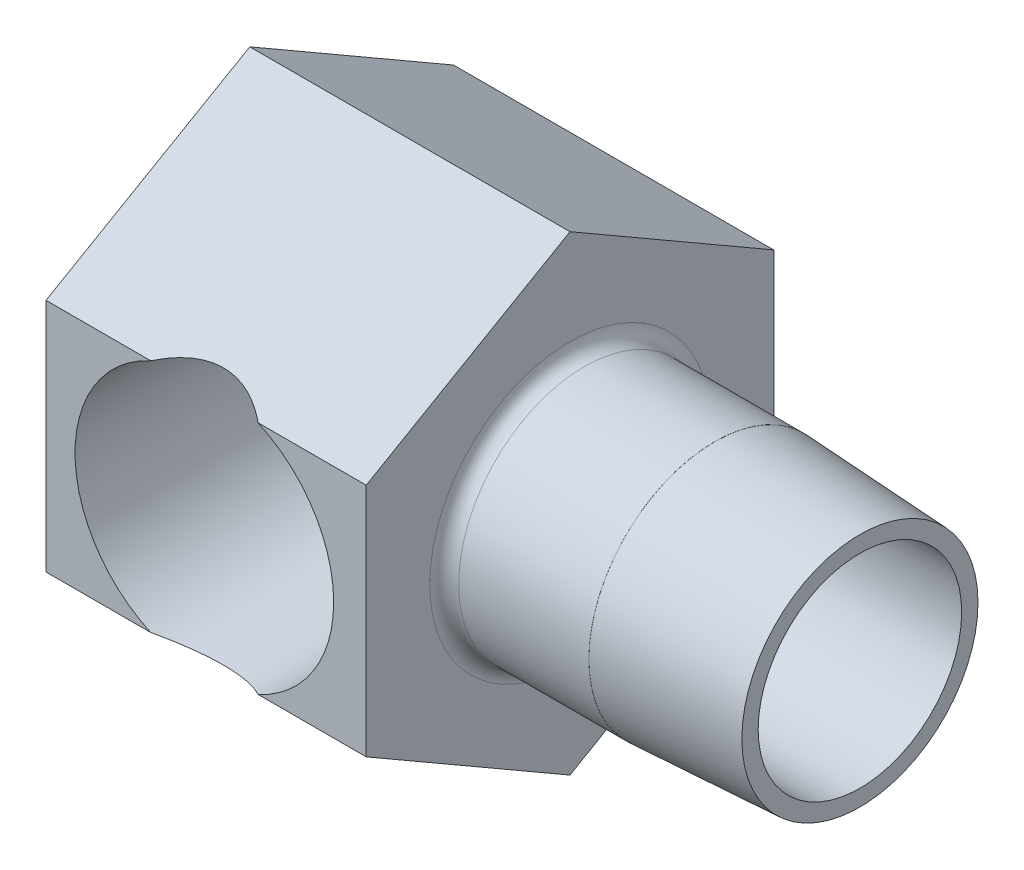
ISO-10303-21;
HEADER;
FILE_DESCRIPTION(('STEP AP214'),'2;1');
FILE_NAME('part.step','',(''),(''),'','','');
FILE_SCHEMA(('AUTOMOTIVE_DESIGN { 1 0 10303 214 1 1 1 1 }'));
ENDSEC;
DATA;
#1=APPLICATION_CONTEXT('core data for automotive mechanical design processes');
#2=APPLICATION_PROTOCOL_DEFINITION('international standard','automotive_design',2000,#1);
#3=PRODUCT_CONTEXT('',#1,'mechanical');
#4=PRODUCT('Part','Part','',(#3));
#5=PRODUCT_RELATED_PRODUCT_CATEGORY('part','',(#4));
#6=PRODUCT_DEFINITION_FORMATION('','',#4);
#7=PRODUCT_DEFINITION_CONTEXT('part definition',#1,'design');
#8=PRODUCT_DEFINITION('design','',#6,#7);
#9=PRODUCT_DEFINITION_SHAPE('','',#8);
#10=(LENGTH_UNIT() NAMED_UNIT(*) SI_UNIT(.MILLI.,.METRE.));
#11=(NAMED_UNIT(*) PLANE_ANGLE_UNIT() SI_UNIT($,.RADIAN.));
#12=(NAMED_UNIT(*) SI_UNIT($,.STERADIAN.) SOLID_ANGLE_UNIT());
#13=UNCERTAINTY_MEASURE_WITH_UNIT(LENGTH_MEASURE(1.E-05),#10,'distance_accuracy_value','');
#14=(GEOMETRIC_REPRESENTATION_CONTEXT(3) GLOBAL_UNCERTAINTY_ASSIGNED_CONTEXT((#13)) GLOBAL_UNIT_ASSIGNED_CONTEXT((#10,
#11,#12)) REPRESENTATION_CONTEXT('',''));
#15=CARTESIAN_POINT('',(0.,0.,0.));
#16=DIRECTION('',(0.,0.,1.));
#17=DIRECTION('',(1.,0.,0.));
#18=AXIS2_PLACEMENT_3D('',#15,#16,#17);
#19=CARTESIAN_POINT('',(7.9248,0.,0.));
#20=DIRECTION('',(-1.,0.,0.));
#21=DIRECTION('',(0.,0.,1.));
#22=AXIS2_PLACEMENT_3D('',#19,#20,#21);
#23=PLANE('',#22);
#24=CARTESIAN_POINT('',(7.9248,0.,0.));
#25=DIRECTION('',(-1.,0.,0.));
#26=DIRECTION('',(0.,0.,1.));
#27=AXIS2_PLACEMENT_3D('',#24,#25,#26);
#28=CIRCLE('',#27,5.5499);
#29=CARTESIAN_POINT('',(7.9248,0.,5.5499));
#30=VERTEX_POINT('',#29);
#31=EDGE_CURVE('E113',#30,#30,#28,.F.);
#32=ORIENTED_EDGE('',*,*,#31,.F.);
#33=EDGE_LOOP('',(#32));
#34=FACE_BOUND('',#33,.T.);
#35=CARTESIAN_POINT('',(7.9248,0.,0.));
#36=DIRECTION('',(1.,0.,0.));
#37=DIRECTION('',(0.,0.,-1.));
#38=AXIS2_PLACEMENT_3D('',#35,#36,#37);
#39=CIRCLE('',#38,6.4389);
#40=CARTESIAN_POINT('',(7.9248,0.,-6.4389));
#41=VERTEX_POINT('',#40);
#42=EDGE_CURVE('E211',#41,#41,#39,.T.);
#43=ORIENTED_EDGE('',*,*,#42,.T.);
#44=EDGE_LOOP('',(#43));
#45=FACE_BOUND('',#44,.T.);
#46=ADVANCED_FACE('F14',(#34,#45),#23,.F.);
#47=CARTESIAN_POINT('',(-7.8867,6.4158048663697,11.1125));
#48=DIRECTION('',(0.,0.,-1.));
#49=DIRECTION('',(0.,1.,0.));
#50=AXIS2_PLACEMENT_3D('',#47,#48,#49);
#51=PLANE('',#50);
#52=CARTESIAN_POINT('',(-16.7132,0.,11.1125));
#53=DIRECTION('',(0.,0.,1.));
#54=DIRECTION('',(1.,0.,0.));
#55=AXIS2_PLACEMENT_3D('',#52,#53,#54);
#56=CIRCLE('',#55,7.05231);
#57=CARTESIAN_POINT('',(-19.6410873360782,6.4158048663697,11.1125));
#58=VERTEX_POINT('',#57);
#59=CARTESIAN_POINT('',(-19.6410873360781,-6.41580486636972,11.1125));
#60=VERTEX_POINT('',#59);
#61=EDGE_CURVE('E220',#58,#60,#56,.T.);
#62=ORIENTED_EDGE('',*,*,#61,.F.);
#63=DIRECTION('',(-1.,0.,0.));
#64=VECTOR('',#63,1.);
#65=CARTESIAN_POINT('',(-7.8867,6.4158048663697,11.1125));
#66=LINE('',#65,#64);
#67=CARTESIAN_POINT('',(-25.3492,6.4158048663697,11.1125));
#68=VERTEX_POINT('',#67);
#69=EDGE_CURVE('E155',#58,#68,#66,.T.);
#70=ORIENTED_EDGE('',*,*,#69,.T.);
#71=DIRECTION('',(0.,-1.,0.));
#72=VECTOR('',#71,1.);
#73=CARTESIAN_POINT('',(-25.3492,6.4158048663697,11.1125));
#74=LINE('',#73,#72);
#75=CARTESIAN_POINT('',(-25.3492,-6.41580486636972,11.1125));
#76=VERTEX_POINT('',#75);
#77=EDGE_CURVE('E125',#68,#76,#74,.T.);
#78=ORIENTED_EDGE('',*,*,#77,.T.);
#79=DIRECTION('',(-1.,0.,0.));
#80=VECTOR('',#79,1.);
#81=CARTESIAN_POINT('',(-7.8867,-6.41580486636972,11.1125));
#82=LINE('',#81,#80);
#83=EDGE_CURVE('E151',#60,#76,#82,.T.);
#84=ORIENTED_EDGE('',*,*,#83,.F.);
#85=EDGE_LOOP('',(#62,#70,#78,#84));
#86=FACE_BOUND('',#85,.T.);
#87=ADVANCED_FACE('F208',(#86),#51,.F.);
#88=CARTESIAN_POINT('',(-13.7853126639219,-6.41580486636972,11.1125));
#89=VERTEX_POINT('',#88);
#90=CARTESIAN_POINT('',(-13.7853126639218,6.4158048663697,11.1125));
#91=VERTEX_POINT('',#90);
#92=EDGE_CURVE('E216',#89,#91,#56,.T.);
#93=ORIENTED_EDGE('',*,*,#92,.F.);
#94=CARTESIAN_POINT('',(-7.8867,-6.41580486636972,11.1125));
#95=VERTEX_POINT('',#94);
#96=EDGE_CURVE('E152',#95,#89,#82,.T.);
#97=ORIENTED_EDGE('',*,*,#96,.F.);
#98=DIRECTION('',(0.,-1.,0.));
#99=VECTOR('',#98,1.);
#100=CARTESIAN_POINT('',(-7.8867,6.4158048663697,11.1125));
#101=LINE('',#100,#99);
#102=CARTESIAN_POINT('',(-7.8867,6.4158048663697,11.1125));
#103=VERTEX_POINT('',#102);
#104=EDGE_CURVE('E142',#103,#95,#101,.T.);
#105=ORIENTED_EDGE('',*,*,#104,.F.);
#106=EDGE_CURVE('E156',#103,#91,#66,.T.);
#107=ORIENTED_EDGE('',*,*,#106,.T.);
#108=EDGE_LOOP('',(#93,#97,#105,#107));
#109=FACE_BOUND('',#108,.T.);
#110=ADVANCED_FACE('F248',(#109),#51,.F.);
#111=CARTESIAN_POINT('',(-7.8867,12.8316097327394,0.));
#112=DIRECTION('',(0.,-0.866025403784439,-0.5));
#113=DIRECTION('',(0.,0.5,-0.866025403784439));
#114=AXIS2_PLACEMENT_3D('',#111,#112,#113);
#115=PLANE('',#114);
#116=ORIENTED_EDGE('',*,*,#69,.F.);
#117=CARTESIAN_POINT('',(-16.7132,-0.384020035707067,22.890142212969));
#118=DIRECTION('',(0.,-0.866025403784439,-0.5));
#119=DIRECTION('',(0.,-0.5,0.866025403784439));
#120=AXIS2_PLACEMENT_3D('',#117,#118,#119);
#121=ELLIPSE('',#120,14.8098967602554,7.39498405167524);
#122=EDGE_CURVE('E105',#58,#91,#121,.T.);
#123=ORIENTED_EDGE('',*,*,#122,.T.);
#124=ORIENTED_EDGE('',*,*,#106,.F.);
#125=DIRECTION('',(0.,-0.5,0.866025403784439));
#126=VECTOR('',#125,1.);
#127=CARTESIAN_POINT('',(-7.8867,12.8316097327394,0.));
#128=LINE('',#127,#126);
#129=CARTESIAN_POINT('',(-7.8867,12.8316097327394,0.));
#130=VERTEX_POINT('',#129);
#131=EDGE_CURVE('E140',#130,#103,#128,.T.);
#132=ORIENTED_EDGE('',*,*,#131,.F.);
#133=DIRECTION('',(-1.,0.,0.));
#134=VECTOR('',#133,1.);
#135=CARTESIAN_POINT('',(-7.8867,12.8316097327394,0.));
#136=LINE('',#135,#134);
#137=CARTESIAN_POINT('',(-25.3492,12.8316097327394,0.));
#138=VERTEX_POINT('',#137);
#139=EDGE_CURVE('E159',#130,#138,#136,.T.);
#140=ORIENTED_EDGE('',*,*,#139,.T.);
#141=DIRECTION('',(0.,-0.5,0.866025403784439));
#142=VECTOR('',#141,1.);
#143=CARTESIAN_POINT('',(-25.3492,12.8316097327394,0.));
#144=LINE('',#143,#142);
#145=EDGE_CURVE('E121',#138,#68,#144,.T.);
#146=ORIENTED_EDGE('',*,*,#145,.T.);
#147=EDGE_LOOP('',(#116,#123,#124,#132,#140,#146));
#148=FACE_BOUND('',#147,.T.);
#149=ADVANCED_FACE('F250',(#148),#115,.F.);
#150=CARTESIAN_POINT('',(-7.8867,-6.41580486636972,11.1125));
#151=DIRECTION('',(0.,0.866025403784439,-0.5));
#152=DIRECTION('',(0.,0.5,0.866025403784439));
#153=AXIS2_PLACEMENT_3D('',#150,#151,#152);
#154=PLANE('',#153);
#155=ORIENTED_EDGE('',*,*,#96,.T.);
#156=CARTESIAN_POINT('',(-16.7132,0.384020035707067,22.890142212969));
#157=DIRECTION('',(0.,0.866025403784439,-0.5));
#158=DIRECTION('',(0.,0.5,0.866025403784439));
#159=AXIS2_PLACEMENT_3D('',#156,#157,#158);
#160=ELLIPSE('',#159,14.8098967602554,7.39498405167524);
#161=EDGE_CURVE('E30',#89,#60,#160,.T.);
#162=ORIENTED_EDGE('',*,*,#161,.T.);
#163=ORIENTED_EDGE('',*,*,#83,.T.);
#164=DIRECTION('',(0.,-0.5,-0.866025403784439));
#165=VECTOR('',#164,1.);
#166=CARTESIAN_POINT('',(-25.3492,-6.41580486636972,11.1125));
#167=LINE('',#166,#165);
#168=CARTESIAN_POINT('',(-25.3492,-12.8316097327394,0.));
#169=VERTEX_POINT('',#168);
#170=EDGE_CURVE('E129',#76,#169,#167,.T.);
#171=ORIENTED_EDGE('',*,*,#170,.T.);
#172=DIRECTION('',(-1.,0.,0.));
#173=VECTOR('',#172,1.);
#174=CARTESIAN_POINT('',(-7.8867,-12.8316097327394,0.));
#175=LINE('',#174,#173);
#176=CARTESIAN_POINT('',(-7.8867,-12.8316097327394,0.));
#177=VERTEX_POINT('',#176);
#178=EDGE_CURVE('E146',#177,#169,#175,.T.);
#179=ORIENTED_EDGE('',*,*,#178,.F.);
#180=DIRECTION('',(0.,-0.5,-0.866025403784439));
#181=VECTOR('',#180,1.);
#182=CARTESIAN_POINT('',(-7.8867,-6.41580486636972,11.1125));
#183=LINE('',#182,#181);
#184=EDGE_CURVE('E144',#95,#177,#183,.T.);
#185=ORIENTED_EDGE('',*,*,#184,.F.);
#186=EDGE_LOOP('',(#155,#162,#163,#171,#179,#185));
#187=FACE_BOUND('',#186,.T.);
#188=ADVANCED_FACE('F227',(#187),#154,.F.);
#189=CARTESIAN_POINT('',(-7.8867,-12.8316097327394,0.));
#190=DIRECTION('',(0.,0.866025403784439,0.5));
#191=DIRECTION('',(0.,-0.5,0.866025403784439));
#192=AXIS2_PLACEMENT_3D('',#189,#190,#191);
#193=PLANE('',#192);
#194=DIRECTION('',(0.,0.5,-0.866025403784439));
#195=VECTOR('',#194,1.);
#196=CARTESIAN_POINT('',(-25.3492,-12.8316097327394,0.));
#197=LINE('',#196,#195);
#198=CARTESIAN_POINT('',(-25.3492,-6.41580486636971,-11.1125));
#199=VERTEX_POINT('',#198);
#200=EDGE_CURVE('E118',#169,#199,#197,.T.);
#201=ORIENTED_EDGE('',*,*,#200,.T.);
#202=DIRECTION('',(-1.,0.,0.));
#203=VECTOR('',#202,1.);
#204=CARTESIAN_POINT('',(-7.8867,-6.41580486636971,-11.1125));
#205=LINE('',#204,#203);
#206=CARTESIAN_POINT('',(-7.8867,-6.41580486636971,-11.1125));
#207=VERTEX_POINT('',#206);
#208=EDGE_CURVE('E165',#207,#199,#205,.T.);
#209=ORIENTED_EDGE('',*,*,#208,.F.);
#210=DIRECTION('',(0.,0.5,-0.866025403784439));
#211=VECTOR('',#210,1.);
#212=CARTESIAN_POINT('',(-7.8867,-12.8316097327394,0.));
#213=LINE('',#212,#211);
#214=EDGE_CURVE('E132',#177,#207,#213,.T.);
#215=ORIENTED_EDGE('',*,*,#214,.F.);
#216=ORIENTED_EDGE('',*,*,#178,.T.);
#217=EDGE_LOOP('',(#201,#209,#215,#216));
#218=FACE_BOUND('',#217,.T.);
#219=ADVANCED_FACE('F239',(#218),#193,.F.);
#220=CARTESIAN_POINT('',(-7.8867,-6.41580486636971,-11.1125));
#221=DIRECTION('',(0.,0.,1.));
#222=DIRECTION('',(1.,0.,0.));
#223=AXIS2_PLACEMENT_3D('',#220,#221,#222);
#224=PLANE('',#223);
#225=DIRECTION('',(0.,1.,0.));
#226=VECTOR('',#225,1.);
#227=CARTESIAN_POINT('',(-25.3492,-6.41580486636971,-11.1125));
#228=LINE('',#227,#226);
#229=CARTESIAN_POINT('',(-25.3492,6.41580486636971,-11.1125));
#230=VERTEX_POINT('',#229);
#231=EDGE_CURVE('E114',#199,#230,#228,.T.);
#232=ORIENTED_EDGE('',*,*,#231,.T.);
#233=DIRECTION('',(-1.,0.,0.));
#234=VECTOR('',#233,1.);
#235=CARTESIAN_POINT('',(-7.8867,6.41580486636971,-11.1125));
#236=LINE('',#235,#234);
#237=CARTESIAN_POINT('',(-7.8867,6.41580486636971,-11.1125));
#238=VERTEX_POINT('',#237);
#239=EDGE_CURVE('E162',#238,#230,#236,.T.);
#240=ORIENTED_EDGE('',*,*,#239,.F.);
#241=DIRECTION('',(0.,1.,0.));
#242=VECTOR('',#241,1.);
#243=CARTESIAN_POINT('',(-7.8867,-6.41580486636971,-11.1125));
#244=LINE('',#243,#242);
#245=EDGE_CURVE('E136',#207,#238,#244,.T.);
#246=ORIENTED_EDGE('',*,*,#245,.F.);
#247=ORIENTED_EDGE('',*,*,#208,.T.);
#248=EDGE_LOOP('',(#232,#240,#246,#247));
#249=FACE_BOUND('',#248,.T.);
#250=ADVANCED_FACE('F257',(#249),#224,.F.);
#251=CARTESIAN_POINT('',(-7.8867,6.4158048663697,-11.1125));
#252=DIRECTION('',(0.,-0.866025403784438,0.5));
#253=DIRECTION('',(0.,-0.5,-0.866025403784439));
#254=AXIS2_PLACEMENT_3D('',#251,#252,#253);
#255=PLANE('',#254);
#256=DIRECTION('',(0.,0.5,0.866025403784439));
#257=VECTOR('',#256,1.);
#258=CARTESIAN_POINT('',(-25.3492,6.4158048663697,-11.1125));
#259=LINE('',#258,#257);
#260=EDGE_CURVE('E117',#230,#138,#259,.T.);
#261=ORIENTED_EDGE('',*,*,#260,.T.);
#262=ORIENTED_EDGE('',*,*,#139,.F.);
#263=DIRECTION('',(0.,0.5,0.866025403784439));
#264=VECTOR('',#263,1.);
#265=CARTESIAN_POINT('',(-7.8867,6.4158048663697,-11.1125));
#266=LINE('',#265,#264);
#267=EDGE_CURVE('E138',#238,#130,#266,.T.);
#268=ORIENTED_EDGE('',*,*,#267,.F.);
#269=ORIENTED_EDGE('',*,*,#239,.T.);
#270=EDGE_LOOP('',(#261,#262,#268,#269));
#271=FACE_BOUND('',#270,.T.);
#272=ADVANCED_FACE('F254',(#271),#255,.F.);
#273=CARTESIAN_POINT('',(-7.8867,-19.2474145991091,11.1125));
#274=DIRECTION('',(-1.,0.,0.));
#275=DIRECTION('',(0.,-1.,0.));
#276=AXIS2_PLACEMENT_3D('',#273,#274,#275);
#277=PLANE('',#276);
#278=CARTESIAN_POINT('',(-7.8867,0.,0.));
#279=DIRECTION('',(-1.,0.,0.));
#280=DIRECTION('',(0.,-1.,0.));
#281=AXIS2_PLACEMENT_3D('',#278,#279,#280);
#282=CIRCLE('',#281,7.6454);
#283=CARTESIAN_POINT('',(-7.8867,-7.6454,0.));
#284=VERTEX_POINT('',#283);
#285=EDGE_CURVE('E168',#284,#284,#282,.T.);
#286=ORIENTED_EDGE('',*,*,#285,.T.);
#287=EDGE_LOOP('',(#286));
#288=FACE_BOUND('',#287,.T.);
#289=ORIENTED_EDGE('',*,*,#214,.T.);
#290=ORIENTED_EDGE('',*,*,#245,.T.);
#291=ORIENTED_EDGE('',*,*,#267,.T.);
#292=ORIENTED_EDGE('',*,*,#131,.T.);
#293=ORIENTED_EDGE('',*,*,#104,.T.);
#294=ORIENTED_EDGE('',*,*,#184,.T.);
#295=EDGE_LOOP('',(#289,#290,#291,#292,#293,#294));
#296=FACE_BOUND('',#295,.T.);
#297=ADVANCED_FACE('F242',(#288,#296),#277,.F.);
#298=CARTESIAN_POINT('',(-25.3492,-19.2474145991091,11.1125));
#299=DIRECTION('',(-1.,0.,0.));
#300=DIRECTION('',(0.,-1.,0.));
#301=AXIS2_PLACEMENT_3D('',#298,#299,#300);
#302=PLANE('',#301);
#303=ORIENTED_EDGE('',*,*,#200,.F.);
#304=ORIENTED_EDGE('',*,*,#170,.F.);
#305=ORIENTED_EDGE('',*,*,#77,.F.);
#306=ORIENTED_EDGE('',*,*,#145,.F.);
#307=ORIENTED_EDGE('',*,*,#260,.F.);
#308=ORIENTED_EDGE('',*,*,#231,.F.);
#309=EDGE_LOOP('',(#303,#304,#305,#306,#307,#308));
#310=FACE_BOUND('',#309,.T.);
#311=ADVANCED_FACE('F235',(#310),#302,.T.);
#312=CARTESIAN_POINT('',(38.1508,0.,0.));
#313=DIRECTION('',(-1.,0.,0.));
#314=DIRECTION('',(0.,0.,1.));
#315=AXIS2_PLACEMENT_3D('',#312,#313,#314);
#316=CYLINDRICAL_SURFACE('',#315,6.858);
#317=CARTESIAN_POINT('',(0.,0.,0.));
#318=DIRECTION('',(-1.,0.,0.));
#319=DIRECTION('',(0.,0.,1.));
#320=AXIS2_PLACEMENT_3D('',#317,#318,#319);
#321=CIRCLE('',#320,6.858);
#322=CARTESIAN_POINT('',(0.,0.,6.858));
#323=VERTEX_POINT('',#322);
#324=EDGE_CURVE('E17',#323,#323,#321,.F.);
#325=ORIENTED_EDGE('',*,*,#324,.F.);
#326=EDGE_LOOP('',(#325));
#327=FACE_BOUND('',#326,.T.);
#328=CARTESIAN_POINT('',(-7.0993,0.,0.));
#329=DIRECTION('',(-1.,0.,0.));
#330=DIRECTION('',(0.,-1.,0.));
#331=AXIS2_PLACEMENT_3D('',#328,#329,#330);
#332=CIRCLE('',#331,6.858);
#333=CARTESIAN_POINT('',(-7.0993,-6.858,0.));
#334=VERTEX_POINT('',#333);
#335=EDGE_CURVE('E171',#334,#334,#332,.F.);
#336=ORIENTED_EDGE('',*,*,#335,.T.);
#337=EDGE_LOOP('',(#336));
#338=FACE_BOUND('',#337,.T.);
#339=ADVANCED_FACE('F279',(#327,#338),#316,.T.);
#340=CARTESIAN_POINT('',(-7.0993,0.,0.));
#341=DIRECTION('',(-1.,0.,0.));
#342=DIRECTION('',(0.,-1.,0.));
#343=AXIS2_PLACEMENT_3D('',#340,#341,#342);
#344=TOROIDAL_SURFACE('',#343,7.6454,0.7874);
#345=ORIENTED_EDGE('',*,*,#335,.F.);
#346=EDGE_LOOP('',(#345));
#347=FACE_BOUND('',#346,.T.);
#348=ORIENTED_EDGE('',*,*,#285,.F.);
#349=EDGE_LOOP('',(#348));
#350=FACE_BOUND('',#349,.T.);
#351=ADVANCED_FACE('F281',(#347,#350),#344,.F.);
#352=CARTESIAN_POINT('',(38.1508,0.,0.));
#353=DIRECTION('',(1.,0.,0.));
#354=DIRECTION('',(0.,0.,-1.));
#355=AXIS2_PLACEMENT_3D('',#352,#353,#354);
#356=CYLINDRICAL_SURFACE('',#355,5.5499);
#357=DIRECTION('',(1.,0.,0.));
#358=VECTOR('',#357,1.);
#359=CARTESIAN_POINT('',(38.1508,1.29165930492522,-5.3975));
#360=LINE('',#359,#358);
#361=CARTESIAN_POINT('',(-10.2836822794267,1.29165930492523,-5.3975));
#362=VERTEX_POINT('',#361);
#363=CARTESIAN_POINT('',(-11.3026422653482,1.29165930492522,-5.3975));
#364=VERTEX_POINT('',#363);
#365=EDGE_CURVE('E22',#362,#364,#360,.F.);
#366=ORIENTED_EDGE('',*,*,#365,.T.);
#367=CARTESIAN_POINT('',(-11.3026422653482,1.29165930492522,-5.3975));
#368=CARTESIAN_POINT('',(-11.2766382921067,1.1828202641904,-5.42356682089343));
#369=CARTESIAN_POINT('',(-11.2537809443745,1.0724477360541,-5.44647861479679));
#370=CARTESIAN_POINT('',(-11.2146636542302,0.849345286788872,-5.48568821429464));
#371=CARTESIAN_POINT('',(-11.1984060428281,0.736614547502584,-5.50198368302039));
#372=CARTESIAN_POINT('',(-11.1731616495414,0.512691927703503,-5.52728657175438));
#373=CARTESIAN_POINT('',(-11.1639879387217,0.401542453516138,-5.53648136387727));
#374=CARTESIAN_POINT('',(-11.1523469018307,0.178567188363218,-5.54814911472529));
#375=CARTESIAN_POINT('',(-11.1498777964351,0.0667415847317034,-5.5506238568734));
#376=CARTESIAN_POINT('',(-11.1516276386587,-0.149498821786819,-5.54887000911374));
#377=CARTESIAN_POINT('',(-11.155420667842,-0.253921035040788,-5.54506831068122));
#378=CARTESIAN_POINT('',(-11.1688401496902,-0.462026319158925,-5.53161799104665));
#379=CARTESIAN_POINT('',(-11.1784674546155,-0.565709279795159,-5.52196851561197));
#380=CARTESIAN_POINT('',(-11.2037399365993,-0.774399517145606,-5.49663735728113));
#381=CARTESIAN_POINT('',(-11.21953684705,-0.87936981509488,-5.48080357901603));
#382=CARTESIAN_POINT('',(-11.256859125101,-1.08722287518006,-5.4433931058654));
#383=CARTESIAN_POINT('',(-11.2783830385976,-1.1901061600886,-5.42181786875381));
#384=CARTESIAN_POINT('',(-11.3026422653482,-1.29165930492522,-5.3975));
#385=B_SPLINE_CURVE_WITH_KNOTS('',3,(#367,#368,#369,#370,#371,#372,#373,#374,#375,#376,#377,
#378,#379,#380,#381,#382,#383,#384),.UNSPECIFIED.,.F.,.F.,(4,2,2,2,2,2,2,2,4),(0.,
0.344637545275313,0.689396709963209,1.02471413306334,1.35994255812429,1.67329546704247,
1.98669416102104,2.30834220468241,2.62990865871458),.UNSPECIFIED.);
#386=CARTESIAN_POINT('',(-11.3026422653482,-1.29165930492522,-5.3975));
#387=VERTEX_POINT('',#386);
#388=EDGE_CURVE('E9',#364,#387,#385,.T.);
#389=ORIENTED_EDGE('',*,*,#388,.T.);
#390=DIRECTION('',(1.,0.,0.));
#391=VECTOR('',#390,1.);
#392=CARTESIAN_POINT('',(38.1508,-1.29165930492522,-5.3975));
#393=LINE('',#392,#391);
#394=CARTESIAN_POINT('',(-10.2836822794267,-1.29165930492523,-5.3975));
#395=VERTEX_POINT('',#394);
#396=EDGE_CURVE('E182',#387,#395,#393,.T.);
#397=ORIENTED_EDGE('',*,*,#396,.T.);
#398=CARTESIAN_POINT('',(-10.2835204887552,-1.29082327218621,-5.39769999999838));
#399=CARTESIAN_POINT('',(-10.3119463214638,-1.43791824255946,-5.3625478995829));
#400=CARTESIAN_POINT('',(-10.3450123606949,-1.58262926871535,-5.32156253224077));
#401=CARTESIAN_POINT('',(-10.4193847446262,-1.86616189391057,-5.22885925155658));
#402=CARTESIAN_POINT('',(-10.4606795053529,-2.00499144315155,-5.17715642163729));
#403=CARTESIAN_POINT('',(-10.5501290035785,-2.27477346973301,-5.0643851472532));
#404=CARTESIAN_POINT('',(-10.5982151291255,-2.40578805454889,-5.00340995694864));
#405=CARTESIAN_POINT('',(-10.7005193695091,-2.66083130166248,-4.8725673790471));
#406=CARTESIAN_POINT('',(-10.7547395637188,-2.78485757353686,-4.80269697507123));
#407=CARTESIAN_POINT('',(-10.8679463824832,-3.02482355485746,-4.6552714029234));
#408=CARTESIAN_POINT('',(-10.9269039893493,-3.1408054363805,-4.57776244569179));
#409=CARTESIAN_POINT('',(-11.0488143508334,-3.365215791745,-4.41541540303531));
#410=CARTESIAN_POINT('',(-11.1117667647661,-3.47364490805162,-4.33057794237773));
#411=CARTESIAN_POINT('',(-11.3056546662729,-3.78827180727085,-4.06520368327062));
#412=CARTESIAN_POINT('',(-11.4412543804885,-3.9830565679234,-3.87427317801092));
#413=CARTESIAN_POINT('',(-11.659889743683,-4.26816238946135,-3.55103381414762));
#414=CARTESIAN_POINT('',(-11.7417689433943,-4.36865172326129,-3.42664075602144));
#415=CARTESIAN_POINT('',(-11.9049100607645,-4.55879004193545,-3.16929311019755));
#416=CARTESIAN_POINT('',(-11.9861717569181,-4.64843529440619,-3.0363355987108));
#417=CARTESIAN_POINT('',(-12.1455575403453,-4.81645966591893,-2.76205413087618));
#418=CARTESIAN_POINT('',(-12.2236864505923,-4.89485662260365,-2.62074393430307));
#419=CARTESIAN_POINT('',(-12.3739315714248,-5.04004510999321,-2.32933562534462));
#420=CARTESIAN_POINT('',(-12.4460519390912,-5.10684469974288,-2.17924371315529));
#421=CARTESIAN_POINT('',(-12.591375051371,-5.23785122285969,-1.84487792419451));
#422=CARTESIAN_POINT('',(-12.662879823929,-5.2999061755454,-1.65899307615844));
#423=CARTESIAN_POINT('',(-12.7846677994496,-5.40502712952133,-1.27528096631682));
#424=CARTESIAN_POINT('',(-12.8349995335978,-5.44813656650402,-1.07748221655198));
#425=CARTESIAN_POINT('',(-12.8885243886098,-5.49679755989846,-0.772935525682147));
#426=CARTESIAN_POINT('',(-12.9027245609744,-5.51038902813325,-0.669341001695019));
#427=CARTESIAN_POINT('',(-12.922716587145,-5.5317354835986,-0.460723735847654));
#428=CARTESIAN_POINT('',(-12.9285091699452,-5.53949097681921,-0.355701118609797));
#429=CARTESIAN_POINT('',(-12.9312623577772,-5.54899639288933,-0.145305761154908));
#430=CARTESIAN_POINT('',(-12.9282263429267,-5.55074861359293,-0.0399331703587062));
#431=CARTESIAN_POINT('',(-12.9134817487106,-5.54828805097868,0.17010674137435));
#432=CARTESIAN_POINT('',(-12.9017731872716,-5.54407527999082,0.274774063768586));
#433=CARTESIAN_POINT('',(-12.8591272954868,-5.52483789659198,0.555935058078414));
#434=CARTESIAN_POINT('',(-12.8204486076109,-5.5042766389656,0.730916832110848));
#435=CARTESIAN_POINT('',(-12.7246233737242,-5.44793106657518,1.07316377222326));
#436=CARTESIAN_POINT('',(-12.6674506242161,-5.41212512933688,1.24041760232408));
#437=CARTESIAN_POINT('',(-12.5471289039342,-5.33165221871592,1.54833640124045));
#438=CARTESIAN_POINT('',(-12.4853185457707,-5.28838367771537,1.68990813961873));
#439=CARTESIAN_POINT('',(-12.3545728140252,-5.19196308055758,1.96630464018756));
#440=CARTESIAN_POINT('',(-12.2856324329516,-5.13880405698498,2.10112456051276));
#441=CARTESIAN_POINT('',(-12.1430319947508,-5.02307732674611,2.36449151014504));
#442=CARTESIAN_POINT('',(-12.0693612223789,-4.96048779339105,2.4930230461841));
#443=CARTESIAN_POINT('',(-11.9194544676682,-4.82635797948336,2.74369442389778));
#444=CARTESIAN_POINT('',(-11.843219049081,-4.75481965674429,2.86583565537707));
#445=CARTESIAN_POINT('',(-11.685088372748,-4.59832635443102,3.1111446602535));
#446=CARTESIAN_POINT('',(-11.6031315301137,-4.51281916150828,3.23392059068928));
#447=CARTESIAN_POINT('',(-11.4397234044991,-4.33199713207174,3.47240364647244));
#448=CARTESIAN_POINT('',(-11.3582721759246,-4.2366812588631,3.58811002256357));
#449=CARTESIAN_POINT('',(-11.1974180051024,-4.03638256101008,3.81202343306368));
#450=CARTESIAN_POINT('',(-11.118012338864,-3.93141354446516,3.9202408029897));
#451=CARTESIAN_POINT('',(-10.9624824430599,-3.71172769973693,4.12885554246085));
#452=CARTESIAN_POINT('',(-10.8863590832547,-3.59700831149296,4.22925084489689));
#453=CARTESIAN_POINT('',(-10.681064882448,-3.26437402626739,4.49664262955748));
#454=CARTESIAN_POINT('',(-10.5567985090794,-3.03572507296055,4.6545513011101));
#455=CARTESIAN_POINT('',(-10.387376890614,-2.67104021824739,4.86690402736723));
#456=CARTESIAN_POINT('',(-10.3337326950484,-2.54586009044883,4.93360319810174));
#457=CARTESIAN_POINT('',(-10.2330287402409,-2.2885620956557,5.05808946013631));
#458=CARTESIAN_POINT('',(-10.1859677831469,-2.15644549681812,5.11587817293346));
#459=CARTESIAN_POINT('',(-10.1063853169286,-1.9076542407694,5.21316788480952));
#460=CARTESIAN_POINT('',(-10.0727424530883,-1.79190088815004,5.25411544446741));
#461=CARTESIAN_POINT('',(-10.0113707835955,-1.55651069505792,5.3285921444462));
#462=CARTESIAN_POINT('',(-9.98364087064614,-1.43687458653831,5.36212267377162));
#463=CARTESIAN_POINT('',(-9.93460468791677,-1.19439983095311,5.42128842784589));
#464=CARTESIAN_POINT('',(-9.91329684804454,-1.0715619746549,5.44692558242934));
#465=CARTESIAN_POINT('',(-9.87752397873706,-0.823504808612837,5.48990585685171));
#466=CARTESIAN_POINT('',(-9.86305623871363,-0.698286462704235,5.5072522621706));
#467=CARTESIAN_POINT('',(-9.84121346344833,-0.445852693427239,5.53342280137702));
#468=CARTESIAN_POINT('',(-9.83386593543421,-0.318631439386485,5.54221388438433));
#469=CARTESIAN_POINT('',(-9.82652218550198,-0.0636718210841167,5.55100044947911));
#470=CARTESIAN_POINT('',(-9.82652598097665,0.0640665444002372,5.55099591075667));
#471=CARTESIAN_POINT('',(-9.83388504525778,0.319031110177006,5.54219101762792));
#472=CARTESIAN_POINT('',(-9.8412406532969,0.446257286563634,5.53339025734));
#473=CARTESIAN_POINT('',(-9.86314160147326,0.699182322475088,5.50714995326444));
#474=CARTESIAN_POINT('',(-9.87768676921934,0.824881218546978,5.48971061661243));
#475=CARTESIAN_POINT('',(-9.91264673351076,1.06681669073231,5.44770634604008));
#476=CARTESIAN_POINT('',(-9.93268491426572,1.18318753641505,5.42359792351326));
#477=CARTESIAN_POINT('',(-9.97853171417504,1.41308832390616,5.36829309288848));
#478=CARTESIAN_POINT('',(-10.0043422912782,1.52661728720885,5.33709427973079));
#479=CARTESIAN_POINT('',(-10.0898031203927,1.8619852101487,5.2334550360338));
#480=CARTESIAN_POINT('',(-10.1575065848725,2.07876635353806,5.15094311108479));
#481=CARTESIAN_POINT('',(-10.3178911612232,2.51543897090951,4.95347944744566));
#482=CARTESIAN_POINT('',(-10.4123640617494,2.73357267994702,4.83614910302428));
#483=CARTESIAN_POINT('',(-10.6170798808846,3.14711164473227,4.5778358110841));
#484=CARTESIAN_POINT('',(-10.7273294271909,3.34250728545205,4.43684291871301));
#485=CARTESIAN_POINT('',(-10.9831823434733,3.74896640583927,4.10242754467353));
#486=CARTESIAN_POINT('',(-11.131318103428,3.95452519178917,3.90423168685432));
#487=CARTESIAN_POINT('',(-11.3586008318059,4.23685264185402,3.58755015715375));
#488=CARTESIAN_POINT('',(-11.4353004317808,4.32671599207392,3.47862033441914));
#489=CARTESIAN_POINT('',(-11.5891947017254,4.49774000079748,3.254472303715));
#490=CARTESIAN_POINT('',(-11.666389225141,4.57890311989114,3.13925588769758));
#491=CARTESIAN_POINT('',(-11.8208853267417,4.73340315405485,2.90115097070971));
#492=CARTESIAN_POINT('',(-11.8981766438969,4.80663208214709,2.77818580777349));
#493=CARTESIAN_POINT('',(-12.0502979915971,4.94395744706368,2.52573386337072));
#494=CARTESIAN_POINT('',(-12.1251274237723,5.00805167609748,2.39624551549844));
#495=CARTESIAN_POINT('',(-12.2701628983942,5.12664196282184,2.13073415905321));
#496=CARTESIAN_POINT('',(-12.3403764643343,5.18115389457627,1.99472244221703));
#497=CARTESIAN_POINT('',(-12.4736809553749,5.28008101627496,1.71581985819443));
#498=CARTESIAN_POINT('',(-12.5367765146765,5.3245027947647,1.57293355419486));
#499=CARTESIAN_POINT('',(-12.6658108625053,5.4112685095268,1.24662772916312));
#500=CARTESIAN_POINT('',(-12.7291459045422,5.45085356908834,1.0613679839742));
#501=CARTESIAN_POINT('',(-12.8068476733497,5.49611259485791,0.776763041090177));
#502=CARTESIAN_POINT('',(-12.8298546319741,5.50884182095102,0.680845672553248));
#503=CARTESIAN_POINT('',(-12.8692395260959,5.52933440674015,0.487155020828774));
#504=CARTESIAN_POINT('',(-12.8856208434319,5.53710030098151,0.389382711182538));
#505=CARTESIAN_POINT('',(-12.9111531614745,5.54748556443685,0.19157964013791));
#506=CARTESIAN_POINT('',(-12.9202273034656,5.55005064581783,0.0915359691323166));
#507=CARTESIAN_POINT('',(-12.930413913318,5.54973569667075,-0.108948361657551));
#508=CARTESIAN_POINT('',(-12.93152684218,5.54685598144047,-0.209388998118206));
#509=CARTESIAN_POINT('',(-12.9257745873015,5.53566138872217,-0.409778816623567));
#510=CARTESIAN_POINT('',(-12.9189057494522,5.52734402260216,-0.509727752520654));
#511=CARTESIAN_POINT('',(-12.8976018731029,5.5054275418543,-0.708267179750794));
#512=CARTESIAN_POINT('',(-12.8831626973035,5.4918255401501,-0.806856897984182));
#513=CARTESIAN_POINT('',(-12.8447278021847,5.45712893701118,-1.01692654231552));
#514=CARTESIAN_POINT('',(-12.819605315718,5.43520467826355,-1.12806192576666));
#515=CARTESIAN_POINT('',(-12.7617236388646,5.38514310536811,-1.34693987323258));
#516=CARTESIAN_POINT('',(-12.7289585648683,5.35700100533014,-1.45467975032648));
#517=CARTESIAN_POINT('',(-12.6572130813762,5.29489520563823,-1.66664484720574));
#518=CARTESIAN_POINT('',(-12.6182170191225,5.2609168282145,-1.77086039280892));
#519=CARTESIAN_POINT('',(-12.535467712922,5.18758941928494,-1.97537468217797));
#520=CARTESIAN_POINT('',(-12.4917156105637,5.14824167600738,-2.07567435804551));
#521=CARTESIAN_POINT('',(-12.3752231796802,5.04107082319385,-2.32739806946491));
#522=CARTESIAN_POINT('',(-12.2999353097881,4.96961386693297,-2.47610428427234));
#523=CARTESIAN_POINT('',(-12.1443655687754,4.81508369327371,-2.76462598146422));
#524=CARTESIAN_POINT('',(-12.0640810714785,4.73200433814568,-2.90443670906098));
#525=CARTESIAN_POINT('',(-11.9011943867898,4.55446924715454,-3.17561003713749));
#526=CARTESIAN_POINT('',(-11.8185885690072,4.45999483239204,-3.30695820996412));
#527=CARTESIAN_POINT('',(-11.6534701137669,4.25996324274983,-3.56093019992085));
#528=CARTESIAN_POINT('',(-11.5709574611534,4.15440825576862,-3.68355573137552));
#529=CARTESIAN_POINT('',(-11.4050968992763,3.92836612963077,-3.92396357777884));
#530=CARTESIAN_POINT('',(-11.3218205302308,3.80748613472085,-4.04142698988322));
#531=CARTESIAN_POINT('',(-11.1593864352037,3.55392137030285,-4.26611413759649));
#532=CARTESIAN_POINT('',(-11.0802295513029,3.42123420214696,-4.3733357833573));
#533=CARTESIAN_POINT('',(-10.928314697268,3.14485348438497,-4.57608058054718));
#534=CARTESIAN_POINT('',(-10.8555294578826,3.00121231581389,-4.67165434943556));
#535=CARTESIAN_POINT('',(-10.7179159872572,2.70291662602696,-4.85034507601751));
#536=CARTESIAN_POINT('',(-10.6530826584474,2.54826926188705,-4.93347002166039));
#537=CARTESIAN_POINT('',(-10.5287574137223,2.21665612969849,-5.09155926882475));
#538=CARTESIAN_POINT('',(-10.4700217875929,2.038885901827,-5.16545627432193));
#539=CARTESIAN_POINT('',(-10.392088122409,1.76426185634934,-5.26291494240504));
#540=CARTESIAN_POINT('',(-10.3677652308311,1.67119024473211,-5.29321906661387));
#541=CARTESIAN_POINT('',(-10.3228075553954,1.48269404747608,-5.34908209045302));
#542=CARTESIAN_POINT('',(-10.302175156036,1.38726798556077,-5.37463792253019));
#543=CARTESIAN_POINT('',(-10.283520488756,1.2908232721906,-5.39769999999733));
#544=B_SPLINE_CURVE_WITH_KNOTS('',3,(#398,#399,#400,#401,#402,#403,#404,#405,#406,#407,#408,
#409,#410,#411,#412,#413,#414,#415,#416,#417,#418,#419,#420,#421,#422,#423,#424,#425,#426,#427,
#428,#429,#430,#431,#432,#433,#434,#435,#436,#437,#438,#439,#440,#441,#442,#443,#444,#445,#446,
#447,#448,#449,#450,#451,#452,#453,#454,#455,#456,#457,#458,#459,#460,#461,#462,#463,#464,#465,
#466,#467,#468,#469,#470,#471,#472,#473,#474,#475,#476,#477,#478,#479,#480,#481,#482,#483,#484,
#485,#486,#487,#488,#489,#490,#491,#492,#493,#494,#495,#496,#497,#498,#499,#500,#501,#502,#503,
#504,#505,#506,#507,#508,#509,#510,#511,#512,#513,#514,#515,#516,#517,#518,#519,#520,#521,#522,
#523,#524,#525,#526,#527,#528,#529,#530,#531,#532,#533,#534,#535,#536,#537,#538,#539,#540,#541,
#542,#543),.UNSPECIFIED.,.F.,.F.,(4,2,2,2,2,2,2,2,2,2,2,2,2,2,2,2,2,2,2,2,2,2,2,2,2,2,2,2,2,2,2,
2,2,2,2,2,2,2,2,2,2,2,2,2,2,2,2,2,2,2,2,2,2,2,2,2,2,2,2,2,2,2,2,2,2,2,2,2,2,2,2,2,4),(0.,
0.461329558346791,0.92201421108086,1.37833951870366,1.83481998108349,2.28869109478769,
2.74252355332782,3.65304009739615,4.19159436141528,4.73033346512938,5.26820855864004,
5.8057083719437,6.42981366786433,7.05248053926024,7.36837231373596,7.68423669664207,
7.99998016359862,8.31572297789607,8.85459341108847,9.39423071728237,9.87481564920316,
10.3557404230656,10.837795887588,11.3197460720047,11.8310943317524,12.3424966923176,
12.8531785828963,13.3639949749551,14.2729996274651,14.7275015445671,15.1819206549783,
15.5634665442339,15.9449409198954,16.3263219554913,16.707551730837,17.0902484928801,
17.472946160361,17.8556614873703,18.2383676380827,18.5995247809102,18.9608046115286,
19.682873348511,20.4753483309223,21.2681572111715,22.2295647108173,22.7113905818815,
23.1930798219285,23.6806666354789,24.1683710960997,24.6552598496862,25.1418297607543,
25.7388115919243,26.0368814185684,26.3347989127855,26.6358104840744,26.9368046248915,
27.237936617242,27.5392333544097,27.8867825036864,28.2346001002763,28.5833055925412,
28.9319275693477,29.4751694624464,30.0186993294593,30.5631325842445,31.1074585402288,
31.6708023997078,32.2342609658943,32.7951763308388,33.3557302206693,33.9579898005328,
34.2603814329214,34.5629677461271),.UNSPECIFIED.);
#545=EDGE_CURVE('E174',#395,#362,#544,.T.);
#546=ORIENTED_EDGE('',*,*,#545,.T.);
#547=EDGE_LOOP('',(#366,#389,#397,#546));
#548=FACE_BOUND('',#547,.T.);
#549=ORIENTED_EDGE('',*,*,#31,.T.);
#550=EDGE_LOOP('',(#549));
#551=FACE_BOUND('',#550,.T.);
#552=ADVANCED_FACE('F184',(#548,#551),#356,.F.);
#553=CARTESIAN_POINT('',(-11.1506,0.,-5.3975));
#554=DIRECTION('',(0.,0.,-1.));
#555=DIRECTION('',(-1.,0.,0.));
#556=AXIS2_PLACEMENT_3D('',#553,#554,#555);
#557=PLANE('',#556);
#558=CARTESIAN_POINT('',(-16.7132,0.,-5.3975));
#559=DIRECTION('',(0.,0.,1.));
#560=DIRECTION('',(1.,0.,0.));
#561=AXIS2_PLACEMENT_3D('',#558,#559,#560);
#562=CIRCLE('',#561,6.55797849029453);
#563=EDGE_CURVE('E37',#362,#395,#562,.T.);
#564=ORIENTED_EDGE('',*,*,#563,.T.);
#565=ORIENTED_EDGE('',*,*,#396,.F.);
#566=CARTESIAN_POINT('',(-16.7132,0.,-5.3975));
#567=DIRECTION('',(0.,0.,1.));
#568=DIRECTION('',(1.,0.,0.));
#569=AXIS2_PLACEMENT_3D('',#566,#567,#568);
#570=CIRCLE('',#569,5.5626);
#571=EDGE_CURVE('E103',#364,#387,#570,.T.);
#572=ORIENTED_EDGE('',*,*,#571,.F.);
#573=ORIENTED_EDGE('',*,*,#365,.F.);
#574=EDGE_LOOP('',(#564,#565,#572,#573));
#575=FACE_BOUND('',#574,.T.);
#576=ADVANCED_FACE('F193',(#575),#557,.F.);
#577=CARTESIAN_POINT('',(-16.7132,0.,11.1125));
#578=DIRECTION('',(0.,0.,1.));
#579=DIRECTION('',(1.,0.,0.));
#580=AXIS2_PLACEMENT_3D('',#577,#578,#579);
#581=CYLINDRICAL_SURFACE('',#580,5.5626);
#582=CARTESIAN_POINT('',(-16.7132,0.,-6.6675));
#583=DIRECTION('',(0.,0.,1.));
#584=DIRECTION('',(1.,0.,0.));
#585=AXIS2_PLACEMENT_3D('',#582,#583,#584);
#586=CIRCLE('',#585,5.5626);
#587=CARTESIAN_POINT('',(-11.1506,0.,-6.6675));
#588=VERTEX_POINT('',#587);
#589=EDGE_CURVE('E101',#588,#588,#586,.T.);
#590=ORIENTED_EDGE('',*,*,#589,.F.);
#591=EDGE_LOOP('',(#590));
#592=FACE_BOUND('',#591,.T.);
#593=ORIENTED_EDGE('',*,*,#571,.T.);
#594=ORIENTED_EDGE('',*,*,#388,.F.);
#595=EDGE_LOOP('',(#593,#594));
#596=FACE_BOUND('',#595,.T.);
#597=ADVANCED_FACE('F191',(#592,#596),#581,.F.);
#598=CARTESIAN_POINT('',(-16.7132,0.,11.1125));
#599=DIRECTION('',(0.,0.,1.));
#600=DIRECTION('',(1.,0.,0.));
#601=AXIS2_PLACEMENT_3D('',#598,#599,#600);
#602=CONICAL_SURFACE('',#601,7.05231,0.0299323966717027);
#603=ORIENTED_EDGE('',*,*,#563,.F.);
#604=ORIENTED_EDGE('',*,*,#545,.F.);
#605=EDGE_LOOP('',(#603,#604));
#606=FACE_BOUND('',#605,.T.);
#607=ORIENTED_EDGE('',*,*,#61,.T.);
#608=ORIENTED_EDGE('',*,*,#161,.F.);
#609=ORIENTED_EDGE('',*,*,#92,.T.);
#610=ORIENTED_EDGE('',*,*,#122,.F.);
#611=EDGE_LOOP('',(#607,#608,#609,#610));
#612=FACE_BOUND('',#611,.T.);
#613=ADVANCED_FACE('F97',(#606,#612),#602,.F.);
#614=CARTESIAN_POINT('',(-16.7132,0.,-6.6675));
#615=DIRECTION('',(0.,0.,1.));
#616=DIRECTION('',(1.,0.,0.));
#617=AXIS2_PLACEMENT_3D('',#614,#615,#616);
#618=CONICAL_SURFACE('',#617,5.5626,1.02974425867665);
#619=CARTESIAN_POINT('',(-16.7132,0.,-10.0098472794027));
#620=VERTEX_POINT('',#619);
#621=VERTEX_LOOP('',#620);
#622=FACE_BOUND('',#621,.T.);
#623=ORIENTED_EDGE('',*,*,#589,.T.);
#624=EDGE_LOOP('',(#623));
#625=FACE_BOUND('',#624,.T.);
#626=ADVANCED_FACE('F93',(#622,#625),#618,.F.);
#627=CARTESIAN_POINT('',(0.,0.,0.));
#628=DIRECTION('',(-1.,0.,0.));
#629=DIRECTION('',(0.,0.,1.));
#630=AXIS2_PLACEMENT_3D('',#627,#628,#629);
#631=CONICAL_SURFACE('',#630,6.85422116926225,0.0523598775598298);
#632=ORIENTED_EDGE('',*,*,#42,.F.);
#633=EDGE_LOOP('',(#632));
#634=FACE_BOUND('',#633,.T.);
#635=CARTESIAN_POINT('',(0.,0.,0.));
#636=DIRECTION('',(1.,0.,0.));
#637=DIRECTION('',(0.,0.,-1.));
#638=AXIS2_PLACEMENT_3D('',#635,#636,#637);
#639=CIRCLE('',#638,6.85422116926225);
#640=CARTESIAN_POINT('',(0.,0.,-6.85422116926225));
#641=VERTEX_POINT('',#640);
#642=EDGE_CURVE('E213',#641,#641,#639,.T.);
#643=ORIENTED_EDGE('',*,*,#642,.T.);
#644=EDGE_LOOP('',(#643));
#645=FACE_BOUND('',#644,.T.);
#646=ADVANCED_FACE('F96',(#634,#645),#631,.T.);
#647=CARTESIAN_POINT('',(0.,0.,-6.85422116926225));
#648=DIRECTION('',(-1.,0.,0.));
#649=DIRECTION('',(0.,0.,1.));
#650=AXIS2_PLACEMENT_3D('',#647,#648,#649);
#651=PLANE('',#650);
#652=ORIENTED_EDGE('',*,*,#324,.T.);
#653=EDGE_LOOP('',(#652));
#654=FACE_BOUND('',#653,.T.);
#655=ORIENTED_EDGE('',*,*,#642,.F.);
#656=EDGE_LOOP('',(#655));
#657=FACE_BOUND('',#656,.T.);
#658=ADVANCED_FACE('F331',(#654,#657),#651,.F.);
#659=CLOSED_SHELL('',(#46,#87,#110,#149,#188,#219,#250,#272,#297,#311,#339,#351,#552,#576,#597,
#613,#626,#646,#658));
#660=MANIFOLD_SOLID_BREP('B1',#659);
#661=ADVANCED_BREP_SHAPE_REPRESENTATION('',(#18,#660),#14);
#662=SHAPE_DEFINITION_REPRESENTATION(#9,#661);
ENDSEC;
END-ISO-10303-21;
